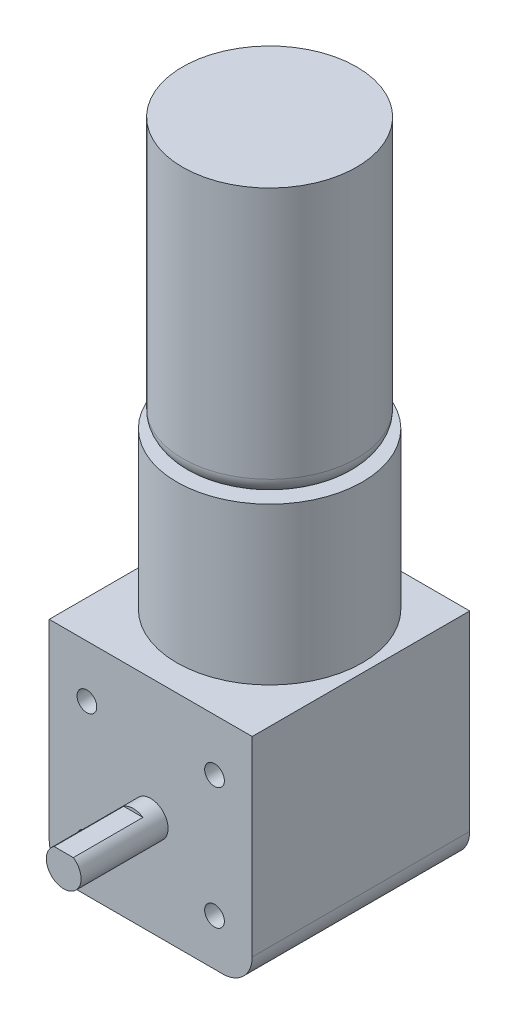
ISO-10303-21;
HEADER;
FILE_DESCRIPTION(('STEP AP214'),'2;1');
FILE_NAME('part.step','',(''),(''),'','','');
FILE_SCHEMA(('AUTOMOTIVE_DESIGN { 1 0 10303 214 1 1 1 1 }'));
ENDSEC;
DATA;
#1=APPLICATION_CONTEXT('core data for automotive mechanical design processes');
#2=APPLICATION_PROTOCOL_DEFINITION('international standard','automotive_design',2000,#1);
#3=PRODUCT_CONTEXT('',#1,'mechanical');
#4=PRODUCT('Part','Part','',(#3));
#5=PRODUCT_RELATED_PRODUCT_CATEGORY('part','',(#4));
#6=PRODUCT_DEFINITION_FORMATION('','',#4);
#7=PRODUCT_DEFINITION_CONTEXT('part definition',#1,'design');
#8=PRODUCT_DEFINITION('design','',#6,#7);
#9=PRODUCT_DEFINITION_SHAPE('','',#8);
#10=(LENGTH_UNIT() NAMED_UNIT(*) SI_UNIT(.MILLI.,.METRE.));
#11=(NAMED_UNIT(*) PLANE_ANGLE_UNIT() SI_UNIT($,.RADIAN.));
#12=(NAMED_UNIT(*) SI_UNIT($,.STERADIAN.) SOLID_ANGLE_UNIT());
#13=UNCERTAINTY_MEASURE_WITH_UNIT(LENGTH_MEASURE(1.E-05),#10,'distance_accuracy_value','');
#14=(GEOMETRIC_REPRESENTATION_CONTEXT(3) GLOBAL_UNCERTAINTY_ASSIGNED_CONTEXT((#13)) GLOBAL_UNIT_ASSIGNED_CONTEXT((#10,
#11,#12)) REPRESENTATION_CONTEXT('',''));
#15=CARTESIAN_POINT('',(0.,0.,0.));
#16=DIRECTION('',(0.,0.,1.));
#17=DIRECTION('',(1.,0.,0.));
#18=AXIS2_PLACEMENT_3D('',#15,#16,#17);
#19=CARTESIAN_POINT('',(-17.5,-38.,18.7500000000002));
#20=DIRECTION('',(0.,0.,1.));
#21=DIRECTION('',(1.,0.,0.));
#22=AXIS2_PLACEMENT_3D('',#19,#20,#21);
#23=PLANE('',#22);
#24=CARTESIAN_POINT('',(-11.,-9.,18.7500000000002));
#25=DIRECTION('',(0.,0.,1.));
#26=DIRECTION('',(1.,0.,0.));
#27=AXIS2_PLACEMENT_3D('',#24,#25,#26);
#28=CIRCLE('',#27,1.7);
#29=CARTESIAN_POINT('',(-9.30000000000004,-9.,18.7500000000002));
#30=VERTEX_POINT('',#29);
#31=EDGE_CURVE('E303',#30,#30,#28,.T.);
#32=ORIENTED_EDGE('',*,*,#31,.F.);
#33=EDGE_LOOP('',(#32));
#34=FACE_BOUND('',#33,.T.);
#35=CARTESIAN_POINT('',(11.,-9.,18.7500000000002));
#36=DIRECTION('',(0.,0.,1.));
#37=DIRECTION('',(1.,0.,0.));
#38=AXIS2_PLACEMENT_3D('',#35,#36,#37);
#39=CIRCLE('',#38,1.7);
#40=CARTESIAN_POINT('',(12.7,-9.,18.7500000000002));
#41=VERTEX_POINT('',#40);
#42=EDGE_CURVE('E309',#41,#41,#39,.T.);
#43=ORIENTED_EDGE('',*,*,#42,.F.);
#44=EDGE_LOOP('',(#43));
#45=FACE_BOUND('',#44,.T.);
#46=CARTESIAN_POINT('',(11.,-30.,18.7500000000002));
#47=DIRECTION('',(0.,0.,1.));
#48=DIRECTION('',(1.,0.,0.));
#49=AXIS2_PLACEMENT_3D('',#46,#47,#48);
#50=CIRCLE('',#49,1.7);
#51=CARTESIAN_POINT('',(12.7,-30.,18.7500000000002));
#52=VERTEX_POINT('',#51);
#53=EDGE_CURVE('E315',#52,#52,#50,.T.);
#54=ORIENTED_EDGE('',*,*,#53,.F.);
#55=EDGE_LOOP('',(#54));
#56=FACE_BOUND('',#55,.T.);
#57=CARTESIAN_POINT('',(-11.,-30.,18.7500000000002));
#58=DIRECTION('',(0.,0.,1.));
#59=DIRECTION('',(1.,0.,0.));
#60=AXIS2_PLACEMENT_3D('',#57,#58,#59);
#61=CIRCLE('',#60,1.7);
#62=CARTESIAN_POINT('',(-9.30000000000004,-30.,18.7500000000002));
#63=VERTEX_POINT('',#62);
#64=EDGE_CURVE('E320',#63,#63,#61,.T.);
#65=ORIENTED_EDGE('',*,*,#64,.F.);
#66=EDGE_LOOP('',(#65));
#67=FACE_BOUND('',#66,.T.);
#68=DIRECTION('',(0.,1.,0.));
#69=VECTOR('',#68,1.);
#70=CARTESIAN_POINT('',(-17.5,-38.,18.7500000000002));
#71=LINE('',#70,#69);
#72=CARTESIAN_POINT('',(-17.5,-32.92,18.7500000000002));
#73=VERTEX_POINT('',#72);
#74=CARTESIAN_POINT('',(-17.5,0.,18.7500000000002));
#75=VERTEX_POINT('',#74);
#76=EDGE_CURVE('E169',#73,#75,#71,.T.);
#77=ORIENTED_EDGE('',*,*,#76,.F.);
#78=CARTESIAN_POINT('',(-12.42,-32.92,18.7500000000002));
#79=DIRECTION('',(0.,0.,1.));
#80=DIRECTION('',(1.,0.,0.));
#81=AXIS2_PLACEMENT_3D('',#78,#79,#80);
#82=CIRCLE('',#81,5.08);
#83=CARTESIAN_POINT('',(-12.42,-38.,18.7500000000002));
#84=VERTEX_POINT('',#83);
#85=EDGE_CURVE('E178',#73,#84,#82,.T.);
#86=ORIENTED_EDGE('',*,*,#85,.T.);
#87=DIRECTION('',(1.,0.,0.));
#88=VECTOR('',#87,1.);
#89=CARTESIAN_POINT('',(-17.5,-38.,18.7500000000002));
#90=LINE('',#89,#88);
#91=CARTESIAN_POINT('',(12.42,-38.,18.7500000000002));
#92=VERTEX_POINT('',#91);
#93=EDGE_CURVE('E151',#84,#92,#90,.T.);
#94=ORIENTED_EDGE('',*,*,#93,.T.);
#95=CARTESIAN_POINT('',(12.42,-32.92,18.7500000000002));
#96=DIRECTION('',(0.,0.,1.));
#97=DIRECTION('',(1.,0.,0.));
#98=AXIS2_PLACEMENT_3D('',#95,#96,#97);
#99=CIRCLE('',#98,5.08);
#100=CARTESIAN_POINT('',(17.5,-32.92,18.7500000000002));
#101=VERTEX_POINT('',#100);
#102=EDGE_CURVE('E176',#92,#101,#99,.T.);
#103=ORIENTED_EDGE('',*,*,#102,.T.);
#104=DIRECTION('',(0.,1.,0.));
#105=VECTOR('',#104,1.);
#106=CARTESIAN_POINT('',(17.5,-38.,18.7500000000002));
#107=LINE('',#106,#105);
#108=CARTESIAN_POINT('',(17.5,0.,18.7500000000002));
#109=VERTEX_POINT('',#108);
#110=EDGE_CURVE('E166',#101,#109,#107,.T.);
#111=ORIENTED_EDGE('',*,*,#110,.T.);
#112=DIRECTION('',(1.,0.,0.));
#113=VECTOR('',#112,1.);
#114=CARTESIAN_POINT('',(-17.5,0.,18.7500000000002));
#115=LINE('',#114,#113);
#116=EDGE_CURVE('E152',#75,#109,#115,.T.);
#117=ORIENTED_EDGE('',*,*,#116,.F.);
#118=EDGE_LOOP('',(#77,#86,#94,#103,#111,#117));
#119=FACE_BOUND('',#118,.T.);
#120=CARTESIAN_POINT('',(0.,-21.,18.7500000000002));
#121=DIRECTION('',(0.,0.,1.));
#122=DIRECTION('',(1.,0.,0.));
#123=AXIS2_PLACEMENT_3D('',#120,#121,#122);
#124=CIRCLE('',#123,3.);
#125=CARTESIAN_POINT('',(3.,-21.,18.7500000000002));
#126=VERTEX_POINT('',#125);
#127=EDGE_CURVE('E125',#126,#126,#124,.T.);
#128=ORIENTED_EDGE('',*,*,#127,.F.);
#129=EDGE_LOOP('',(#128));
#130=FACE_BOUND('',#129,.T.);
#131=ADVANCED_FACE('F33',(#34,#45,#56,#67,#119,#130),#23,.T.);
#132=CARTESIAN_POINT('',(0.,27.,-1.74999999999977));
#133=DIRECTION('',(0.,1.,0.));
#134=DIRECTION('',(0.,0.,1.));
#135=AXIS2_PLACEMENT_3D('',#132,#133,#134);
#136=PLANE('',#135);
#137=CARTESIAN_POINT('',(0.,27.,-1.74999999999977));
#138=DIRECTION('',(0.,1.,0.));
#139=DIRECTION('',(0.,0.,1.));
#140=AXIS2_PLACEMENT_3D('',#137,#138,#139);
#141=CIRCLE('',#140,16.);
#142=CARTESIAN_POINT('',(0.,27.,14.2500000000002));
#143=VERTEX_POINT('',#142);
#144=EDGE_CURVE('E142',#143,#143,#141,.T.);
#145=ORIENTED_EDGE('',*,*,#144,.T.);
#146=EDGE_LOOP('',(#145));
#147=FACE_BOUND('',#146,.T.);
#148=CARTESIAN_POINT('',(0.,27.,-1.74999999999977));
#149=DIRECTION('',(0.,1.,0.));
#150=DIRECTION('',(0.,0.,1.));
#151=AXIS2_PLACEMENT_3D('',#148,#149,#150);
#152=CIRCLE('',#151,12.);
#153=CARTESIAN_POINT('',(0.,27.,10.2500000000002));
#154=VERTEX_POINT('',#153);
#155=EDGE_CURVE('E124',#154,#154,#152,.T.);
#156=ORIENTED_EDGE('',*,*,#155,.F.);
#157=EDGE_LOOP('',(#156));
#158=FACE_BOUND('',#157,.T.);
#159=ADVANCED_FACE('F226',(#147,#158),#136,.T.);
#160=CARTESIAN_POINT('',(0.,0.,0.));
#161=DIRECTION('',(0.,1.,0.));
#162=DIRECTION('',(0.,0.,1.));
#163=AXIS2_PLACEMENT_3D('',#160,#161,#162);
#164=PLANE('',#163);
#165=DIRECTION('',(0.,0.,-1.));
#166=VECTOR('',#165,1.);
#167=CARTESIAN_POINT('',(17.5,0.,-18.7499999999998));
#168=LINE('',#167,#166);
#169=CARTESIAN_POINT('',(17.5,0.,-18.7499999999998));
#170=VERTEX_POINT('',#169);
#171=EDGE_CURVE('E145',#109,#170,#168,.T.);
#172=ORIENTED_EDGE('',*,*,#171,.T.);
#173=DIRECTION('',(-1.,0.,0.));
#174=VECTOR('',#173,1.);
#175=CARTESIAN_POINT('',(-17.5,0.,-18.7499999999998));
#176=LINE('',#175,#174);
#177=CARTESIAN_POINT('',(-17.5,0.,-18.7499999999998));
#178=VERTEX_POINT('',#177);
#179=EDGE_CURVE('E158',#170,#178,#176,.T.);
#180=ORIENTED_EDGE('',*,*,#179,.T.);
#181=DIRECTION('',(0.,0.,1.));
#182=VECTOR('',#181,1.);
#183=CARTESIAN_POINT('',(-17.5,0.,-18.7499999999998));
#184=LINE('',#183,#182);
#185=EDGE_CURVE('E161',#178,#75,#184,.T.);
#186=ORIENTED_EDGE('',*,*,#185,.T.);
#187=ORIENTED_EDGE('',*,*,#116,.T.);
#188=EDGE_LOOP('',(#172,#180,#186,#187));
#189=FACE_BOUND('',#188,.T.);
#190=CARTESIAN_POINT('',(0.,0.,-1.74999999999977));
#191=DIRECTION('',(0.,1.,0.));
#192=DIRECTION('',(0.,0.,1.));
#193=AXIS2_PLACEMENT_3D('',#190,#191,#192);
#194=CIRCLE('',#193,16.);
#195=CARTESIAN_POINT('',(0.,0.,14.2500000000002));
#196=VERTEX_POINT('',#195);
#197=EDGE_CURVE('E141',#196,#196,#194,.T.);
#198=ORIENTED_EDGE('',*,*,#197,.F.);
#199=EDGE_LOOP('',(#198));
#200=FACE_BOUND('',#199,.T.);
#201=ADVANCED_FACE('F200',(#189,#200),#164,.T.);
#202=CARTESIAN_POINT('',(17.5,-38.,-18.7499999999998));
#203=DIRECTION('',(1.,0.,0.));
#204=DIRECTION('',(0.,0.,-1.));
#205=AXIS2_PLACEMENT_3D('',#202,#203,#204);
#206=PLANE('',#205);
#207=ORIENTED_EDGE('',*,*,#110,.F.);
#208=DIRECTION('',(0.,0.,-1.));
#209=VECTOR('',#208,1.);
#210=CARTESIAN_POINT('',(17.5,-32.92,-18.7499999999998));
#211=LINE('',#210,#209);
#212=CARTESIAN_POINT('',(17.5,-32.92,-18.7499999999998));
#213=VERTEX_POINT('',#212);
#214=EDGE_CURVE('E116',#101,#213,#211,.T.);
#215=ORIENTED_EDGE('',*,*,#214,.T.);
#216=DIRECTION('',(0.,1.,0.));
#217=VECTOR('',#216,1.);
#218=CARTESIAN_POINT('',(17.5,-38.,-18.7499999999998));
#219=LINE('',#218,#217);
#220=EDGE_CURVE('E155',#213,#170,#219,.T.);
#221=ORIENTED_EDGE('',*,*,#220,.T.);
#222=ORIENTED_EDGE('',*,*,#171,.F.);
#223=EDGE_LOOP('',(#207,#215,#221,#222));
#224=FACE_BOUND('',#223,.T.);
#225=ADVANCED_FACE('F190',(#224),#206,.T.);
#226=CARTESIAN_POINT('',(-17.5,-38.,-18.7499999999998));
#227=DIRECTION('',(-1.,0.,0.));
#228=DIRECTION('',(0.,0.,1.));
#229=AXIS2_PLACEMENT_3D('',#226,#227,#228);
#230=PLANE('',#229);
#231=DIRECTION('',(0.,1.,0.));
#232=VECTOR('',#231,1.);
#233=CARTESIAN_POINT('',(-17.5,-38.,-18.7499999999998));
#234=LINE('',#233,#232);
#235=CARTESIAN_POINT('',(-17.5,-32.92,-18.7499999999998));
#236=VERTEX_POINT('',#235);
#237=EDGE_CURVE('E171',#236,#178,#234,.T.);
#238=ORIENTED_EDGE('',*,*,#237,.F.);
#239=DIRECTION('',(0.,0.,1.));
#240=VECTOR('',#239,1.);
#241=CARTESIAN_POINT('',(-17.5,-32.92,18.7500000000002));
#242=LINE('',#241,#240);
#243=EDGE_CURVE('E168',#236,#73,#242,.T.);
#244=ORIENTED_EDGE('',*,*,#243,.T.);
#245=ORIENTED_EDGE('',*,*,#76,.T.);
#246=ORIENTED_EDGE('',*,*,#185,.F.);
#247=EDGE_LOOP('',(#238,#244,#245,#246));
#248=FACE_BOUND('',#247,.T.);
#249=ADVANCED_FACE('F215',(#248),#230,.T.);
#250=CARTESIAN_POINT('',(-17.5,-38.,-18.7499999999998));
#251=DIRECTION('',(0.,0.,-1.));
#252=DIRECTION('',(-1.,0.,0.));
#253=AXIS2_PLACEMENT_3D('',#250,#251,#252);
#254=PLANE('',#253);
#255=DIRECTION('',(-1.,0.,0.));
#256=VECTOR('',#255,1.);
#257=CARTESIAN_POINT('',(-17.5,-38.,-18.7499999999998));
#258=LINE('',#257,#256);
#259=CARTESIAN_POINT('',(12.42,-38.,-18.7499999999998));
#260=VERTEX_POINT('',#259);
#261=CARTESIAN_POINT('',(-12.42,-38.,-18.7499999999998));
#262=VERTEX_POINT('',#261);
#263=EDGE_CURVE('E148',#260,#262,#258,.T.);
#264=ORIENTED_EDGE('',*,*,#263,.T.);
#265=CARTESIAN_POINT('',(-12.42,-32.92,-18.7499999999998));
#266=DIRECTION('',(0.,0.,-1.));
#267=DIRECTION('',(-1.,0.,0.));
#268=AXIS2_PLACEMENT_3D('',#265,#266,#267);
#269=CIRCLE('',#268,5.08);
#270=EDGE_CURVE('E185',#262,#236,#269,.T.);
#271=ORIENTED_EDGE('',*,*,#270,.T.);
#272=ORIENTED_EDGE('',*,*,#237,.T.);
#273=ORIENTED_EDGE('',*,*,#179,.F.);
#274=ORIENTED_EDGE('',*,*,#220,.F.);
#275=CARTESIAN_POINT('',(12.42,-32.92,-18.7499999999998));
#276=DIRECTION('',(0.,0.,-1.));
#277=DIRECTION('',(-1.,0.,0.));
#278=AXIS2_PLACEMENT_3D('',#275,#276,#277);
#279=CIRCLE('',#278,5.08);
#280=EDGE_CURVE('E56',#213,#260,#279,.T.);
#281=ORIENTED_EDGE('',*,*,#280,.T.);
#282=EDGE_LOOP('',(#264,#271,#272,#273,#274,#281));
#283=FACE_BOUND('',#282,.T.);
#284=ADVANCED_FACE('F195',(#283),#254,.T.);
#285=CARTESIAN_POINT('',(0.,-38.,0.));
#286=DIRECTION('',(0.,1.,0.));
#287=DIRECTION('',(0.,0.,1.));
#288=AXIS2_PLACEMENT_3D('',#285,#286,#287);
#289=PLANE('',#288);
#290=ORIENTED_EDGE('',*,*,#93,.F.);
#291=DIRECTION('',(0.,0.,1.));
#292=VECTOR('',#291,1.);
#293=CARTESIAN_POINT('',(-12.42,-38.,-18.7499999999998));
#294=LINE('',#293,#292);
#295=EDGE_CURVE('E182',#84,#262,#294,.F.);
#296=ORIENTED_EDGE('',*,*,#295,.T.);
#297=ORIENTED_EDGE('',*,*,#263,.F.);
#298=DIRECTION('',(0.,0.,-1.));
#299=VECTOR('',#298,1.);
#300=CARTESIAN_POINT('',(12.42,-38.,18.7500000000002));
#301=LINE('',#300,#299);
#302=EDGE_CURVE('E180',#260,#92,#301,.F.);
#303=ORIENTED_EDGE('',*,*,#302,.T.);
#304=EDGE_LOOP('',(#290,#296,#297,#303));
#305=FACE_BOUND('',#304,.T.);
#306=ADVANCED_FACE('F208',(#305),#289,.F.);
#307=CARTESIAN_POINT('',(0.,27.,-1.74999999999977));
#308=DIRECTION('',(0.,-1.,0.));
#309=DIRECTION('',(0.,0.,-1.));
#310=AXIS2_PLACEMENT_3D('',#307,#308,#309);
#311=CYLINDRICAL_SURFACE('',#310,16.);
#312=ORIENTED_EDGE('',*,*,#144,.F.);
#313=EDGE_LOOP('',(#312));
#314=FACE_BOUND('',#313,.T.);
#315=ORIENTED_EDGE('',*,*,#197,.T.);
#316=EDGE_LOOP('',(#315));
#317=FACE_BOUND('',#316,.T.);
#318=ADVANCED_FACE('F240',(#314,#317),#311,.T.);
#319=CARTESIAN_POINT('',(0.,30.,-1.74999999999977));
#320=DIRECTION('',(0.,1.,0.));
#321=DIRECTION('',(0.,0.,1.));
#322=AXIS2_PLACEMENT_3D('',#319,#320,#321);
#323=TOROIDAL_SURFACE('',#322,12.,3.);
#324=ORIENTED_EDGE('',*,*,#155,.T.);
#325=EDGE_LOOP('',(#324));
#326=FACE_BOUND('',#325,.T.);
#327=CARTESIAN_POINT('',(0.,30.,-1.74999999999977));
#328=DIRECTION('',(0.,1.,0.));
#329=DIRECTION('',(0.,0.,1.));
#330=AXIS2_PLACEMENT_3D('',#327,#328,#329);
#331=CIRCLE('',#330,15.);
#332=CARTESIAN_POINT('',(0.,30.,-16.7499999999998));
#333=VERTEX_POINT('',#332);
#334=EDGE_CURVE('E128',#333,#333,#331,.T.);
#335=ORIENTED_EDGE('',*,*,#334,.F.);
#336=EDGE_LOOP('',(#335));
#337=FACE_BOUND('',#336,.T.);
#338=ADVANCED_FACE('F242',(#326,#337),#323,.T.);
#339=CARTESIAN_POINT('',(0.,73.5,-1.74999999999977));
#340=DIRECTION('',(0.,1.,0.));
#341=DIRECTION('',(0.,0.,1.));
#342=AXIS2_PLACEMENT_3D('',#339,#340,#341);
#343=PLANE('',#342);
#344=CARTESIAN_POINT('',(0.,73.5,-1.74999999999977));
#345=DIRECTION('',(0.,1.,0.));
#346=DIRECTION('',(0.,0.,1.));
#347=AXIS2_PLACEMENT_3D('',#344,#345,#346);
#348=CIRCLE('',#347,15.);
#349=CARTESIAN_POINT('',(0.,73.5,-16.7499999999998));
#350=VERTEX_POINT('',#349);
#351=EDGE_CURVE('E138',#350,#350,#348,.T.);
#352=ORIENTED_EDGE('',*,*,#351,.T.);
#353=EDGE_LOOP('',(#352));
#354=FACE_BOUND('',#353,.T.);
#355=ADVANCED_FACE('F248',(#354),#343,.T.);
#356=CARTESIAN_POINT('',(0.,73.5,-1.74999999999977));
#357=DIRECTION('',(0.,-1.,0.));
#358=DIRECTION('',(0.,0.,-1.));
#359=AXIS2_PLACEMENT_3D('',#356,#357,#358);
#360=CYLINDRICAL_SURFACE('',#359,15.);
#361=CARTESIAN_POINT('',(0.,30.,-16.7499999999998));
#362=CARTESIAN_POINT('',(0.,30.453125,-16.7499999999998));
#363=CARTESIAN_POINT('',(0.,30.90625,-16.7499999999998));
#364=CARTESIAN_POINT('',(0.,31.8125,-16.7499999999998));
#365=CARTESIAN_POINT('',(0.,32.265625,-16.7499999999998));
#366=CARTESIAN_POINT('',(0.,33.171875,-16.7499999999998));
#367=CARTESIAN_POINT('',(0.,33.625,-16.7499999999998));
#368=CARTESIAN_POINT('',(0.,34.53125,-16.7499999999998));
#369=CARTESIAN_POINT('',(0.,34.984375,-16.7499999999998));
#370=CARTESIAN_POINT('',(0.,35.890625,-16.7499999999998));
#371=CARTESIAN_POINT('',(0.,36.34375,-16.7499999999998));
#372=CARTESIAN_POINT('',(0.,37.25,-16.7499999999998));
#373=CARTESIAN_POINT('',(0.,37.703125,-16.7499999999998));
#374=CARTESIAN_POINT('',(0.,38.609375,-16.7499999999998));
#375=CARTESIAN_POINT('',(0.,39.0625,-16.7499999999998));
#376=CARTESIAN_POINT('',(0.,39.96875,-16.7499999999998));
#377=CARTESIAN_POINT('',(0.,40.421875,-16.7499999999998));
#378=CARTESIAN_POINT('',(0.,41.328125,-16.7499999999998));
#379=CARTESIAN_POINT('',(0.,41.78125,-16.7499999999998));
#380=CARTESIAN_POINT('',(0.,42.6875,-16.7499999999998));
#381=CARTESIAN_POINT('',(0.,43.140625,-16.7499999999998));
#382=CARTESIAN_POINT('',(0.,44.046875,-16.7499999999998));
#383=CARTESIAN_POINT('',(0.,44.5,-16.7499999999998));
#384=CARTESIAN_POINT('',(0.,45.40625,-16.7499999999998));
#385=CARTESIAN_POINT('',(0.,45.859375,-16.7499999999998));
#386=CARTESIAN_POINT('',(0.,46.765625,-16.7499999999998));
#387=CARTESIAN_POINT('',(0.,47.21875,-16.7499999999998));
#388=CARTESIAN_POINT('',(0.,48.125,-16.7499999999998));
#389=CARTESIAN_POINT('',(0.,48.578125,-16.7499999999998));
#390=CARTESIAN_POINT('',(0.,49.484375,-16.7499999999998));
#391=CARTESIAN_POINT('',(0.,49.9375,-16.7499999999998));
#392=CARTESIAN_POINT('',(0.,50.84375,-16.7499999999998));
#393=CARTESIAN_POINT('',(0.,51.296875,-16.7499999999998));
#394=CARTESIAN_POINT('',(0.,52.203125,-16.7499999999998));
#395=CARTESIAN_POINT('',(0.,52.65625,-16.7499999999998));
#396=CARTESIAN_POINT('',(0.,53.5625,-16.7499999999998));
#397=CARTESIAN_POINT('',(0.,54.015625,-16.7499999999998));
#398=CARTESIAN_POINT('',(0.,54.921875,-16.7499999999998));
#399=CARTESIAN_POINT('',(0.,55.375,-16.7499999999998));
#400=CARTESIAN_POINT('',(0.,56.28125,-16.7499999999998));
#401=CARTESIAN_POINT('',(0.,56.734375,-16.7499999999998));
#402=CARTESIAN_POINT('',(0.,57.640625,-16.7499999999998));
#403=CARTESIAN_POINT('',(0.,58.09375,-16.7499999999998));
#404=CARTESIAN_POINT('',(0.,59.,-16.7499999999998));
#405=CARTESIAN_POINT('',(0.,59.453125,-16.7499999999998));
#406=CARTESIAN_POINT('',(0.,60.359375,-16.7499999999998));
#407=CARTESIAN_POINT('',(0.,60.8125,-16.7499999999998));
#408=CARTESIAN_POINT('',(0.,61.71875,-16.7499999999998));
#409=CARTESIAN_POINT('',(0.,62.171875,-16.7499999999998));
#410=CARTESIAN_POINT('',(0.,63.078125,-16.7499999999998));
#411=CARTESIAN_POINT('',(0.,63.53125,-16.7499999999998));
#412=CARTESIAN_POINT('',(0.,64.4375,-16.7499999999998));
#413=CARTESIAN_POINT('',(0.,64.890625,-16.7499999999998));
#414=CARTESIAN_POINT('',(0.,65.796875,-16.7499999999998));
#415=CARTESIAN_POINT('',(0.,66.25,-16.7499999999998));
#416=CARTESIAN_POINT('',(0.,67.15625,-16.7499999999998));
#417=CARTESIAN_POINT('',(0.,67.609375,-16.7499999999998));
#418=CARTESIAN_POINT('',(0.,68.515625,-16.7499999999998));
#419=CARTESIAN_POINT('',(0.,68.96875,-16.7499999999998));
#420=CARTESIAN_POINT('',(0.,69.875,-16.7499999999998));
#421=CARTESIAN_POINT('',(0.,70.328125,-16.7499999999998));
#422=CARTESIAN_POINT('',(0.,71.234375,-16.7499999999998));
#423=CARTESIAN_POINT('',(0.,71.6875,-16.7499999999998));
#424=CARTESIAN_POINT('',(0.,72.59375,-16.7499999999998));
#425=CARTESIAN_POINT('',(0.,73.046875,-16.7499999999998));
#426=CARTESIAN_POINT('',(0.,73.5,-16.7499999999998));
#427=B_SPLINE_CURVE_WITH_KNOTS('',3,(#361,#362,#363,#364,#365,#366,#367,#368,#369,#370,#371,
#372,#373,#374,#375,#376,#377,#378,#379,#380,#381,#382,#383,#384,#385,#386,#387,#388,#389,#390,
#391,#392,#393,#394,#395,#396,#397,#398,#399,#400,#401,#402,#403,#404,#405,#406,#407,#408,#409,
#410,#411,#412,#413,#414,#415,#416,#417,#418,#419,#420,#421,#422,#423,#424,#425,#426),
.UNSPECIFIED.,.F.,.F.,(4,2,2,2,2,2,2,2,2,2,2,2,2,2,2,2,2,2,2,2,2,2,2,2,2,2,2,2,2,2,2,2,4),(0.,
1.359375,2.71875,4.078125,5.4375,6.796875,8.15625,9.515625,10.875,12.234375,13.59375,14.953125,
16.3125,17.671875,19.03125,20.390625,21.75,23.109375,24.46875,25.828125,27.1875,28.546875,
29.90625,31.265625,32.625,33.984375,35.34375,36.703125,38.0625,39.421875,40.78125,42.140625,
43.5),.UNSPECIFIED.);
#428=EDGE_CURVE('BSEAM245',#333,#350,#427,.T.);
#429=ORIENTED_EDGE('',*,*,#334,.T.);
#430=ORIENTED_EDGE('',*,*,#351,.F.);
#431=ORIENTED_EDGE('',*,*,#428,.T.);
#432=ORIENTED_EDGE('',*,*,#428,.F.);
#433=EDGE_LOOP('',(#429,#431,#430,#432));
#434=FACE_BOUND('',#433,.T.);
#435=ADVANCED_FACE('F245',(#434),#360,.T.);
#436=CARTESIAN_POINT('',(0.,-21.,33.7500000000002));
#437=DIRECTION('',(0.,0.,-1.));
#438=DIRECTION('',(-1.,0.,0.));
#439=AXIS2_PLACEMENT_3D('',#436,#437,#438);
#440=CYLINDRICAL_SURFACE('',#439,3.);
#441=CARTESIAN_POINT('',(0.,-21.,33.7500000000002));
#442=DIRECTION('',(0.,0.,1.));
#443=DIRECTION('',(1.,0.,0.));
#444=AXIS2_PLACEMENT_3D('',#441,#442,#443);
#445=CIRCLE('',#444,3.);
#446=CARTESIAN_POINT('',(-1.6583123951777,-18.5,33.7500000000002));
#447=VERTEX_POINT('',#446);
#448=CARTESIAN_POINT('',(1.6583123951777,-18.5,33.7500000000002));
#449=VERTEX_POINT('',#448);
#450=EDGE_CURVE('E120',#447,#449,#445,.T.);
#451=ORIENTED_EDGE('',*,*,#450,.F.);
#452=DIRECTION('',(0.,0.,-1.));
#453=VECTOR('',#452,1.);
#454=CARTESIAN_POINT('',(-1.6583123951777,-18.5,33.7500000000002));
#455=LINE('',#454,#453);
#456=CARTESIAN_POINT('',(-1.6583123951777,-18.5,21.7500000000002));
#457=VERTEX_POINT('',#456);
#458=EDGE_CURVE('E48',#447,#457,#455,.T.);
#459=ORIENTED_EDGE('',*,*,#458,.T.);
#460=CARTESIAN_POINT('',(0.,-21.,21.7500000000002));
#461=DIRECTION('',(0.,0.,1.));
#462=DIRECTION('',(1.,0.,0.));
#463=AXIS2_PLACEMENT_3D('',#460,#461,#462);
#464=CIRCLE('',#463,3.);
#465=CARTESIAN_POINT('',(1.6583123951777,-18.5,21.7500000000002));
#466=VERTEX_POINT('',#465);
#467=EDGE_CURVE('E11',#466,#457,#464,.T.);
#468=ORIENTED_EDGE('',*,*,#467,.F.);
#469=DIRECTION('',(0.,0.,-1.));
#470=VECTOR('',#469,1.);
#471=CARTESIAN_POINT('',(1.6583123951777,-18.5,33.7500000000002));
#472=LINE('',#471,#470);
#473=EDGE_CURVE('E111',#466,#449,#472,.F.);
#474=ORIENTED_EDGE('',*,*,#473,.T.);
#475=EDGE_LOOP('',(#451,#459,#468,#474));
#476=FACE_BOUND('',#475,.T.);
#477=ORIENTED_EDGE('',*,*,#127,.T.);
#478=EDGE_LOOP('',(#477));
#479=FACE_BOUND('',#478,.T.);
#480=ADVANCED_FACE('F118',(#476,#479),#440,.T.);
#481=CARTESIAN_POINT('',(0.,-21.,33.7500000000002));
#482=DIRECTION('',(0.,0.,1.));
#483=DIRECTION('',(1.,0.,0.));
#484=AXIS2_PLACEMENT_3D('',#481,#482,#483);
#485=PLANE('',#484);
#486=DIRECTION('',(1.,0.,0.));
#487=VECTOR('',#486,1.);
#488=CARTESIAN_POINT('',(0.,-18.5,33.7500000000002));
#489=LINE('',#488,#487);
#490=EDGE_CURVE('E41',#447,#449,#489,.T.);
#491=ORIENTED_EDGE('',*,*,#490,.F.);
#492=ORIENTED_EDGE('',*,*,#450,.T.);
#493=EDGE_LOOP('',(#491,#492));
#494=FACE_BOUND('',#493,.T.);
#495=ADVANCED_FACE('F123',(#494),#485,.T.);
#496=CARTESIAN_POINT('',(-11.,-30.,6.05000000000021));
#497=DIRECTION('',(0.,0.,1.));
#498=DIRECTION('',(1.,0.,0.));
#499=AXIS2_PLACEMENT_3D('',#496,#497,#498);
#500=CONICAL_SURFACE('',#499,1.7,1.02974425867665);
#501=CARTESIAN_POINT('',(-11.,-30.,5.02853694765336));
#502=VERTEX_POINT('',#501);
#503=VERTEX_LOOP('',#502);
#504=FACE_BOUND('',#503,.T.);
#505=CARTESIAN_POINT('',(-11.,-30.,6.05000000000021));
#506=DIRECTION('',(0.,0.,1.));
#507=DIRECTION('',(1.,0.,0.));
#508=AXIS2_PLACEMENT_3D('',#505,#506,#507);
#509=CIRCLE('',#508,1.7);
#510=CARTESIAN_POINT('',(-9.30000000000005,-30.,6.05000000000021));
#511=VERTEX_POINT('',#510);
#512=EDGE_CURVE('E131',#511,#511,#509,.T.);
#513=ORIENTED_EDGE('',*,*,#512,.T.);
#514=EDGE_LOOP('',(#513));
#515=FACE_BOUND('',#514,.T.);
#516=ADVANCED_FACE('F260',(#504,#515),#500,.F.);
#517=CARTESIAN_POINT('',(-11.,-30.,18.7500000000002));
#518=DIRECTION('',(0.,0.,1.));
#519=DIRECTION('',(1.,0.,0.));
#520=AXIS2_PLACEMENT_3D('',#517,#518,#519);
#521=CYLINDRICAL_SURFACE('',#520,1.7);
#522=ORIENTED_EDGE('',*,*,#512,.F.);
#523=EDGE_LOOP('',(#522));
#524=FACE_BOUND('',#523,.T.);
#525=ORIENTED_EDGE('',*,*,#64,.T.);
#526=EDGE_LOOP('',(#525));
#527=FACE_BOUND('',#526,.T.);
#528=ADVANCED_FACE('F263',(#524,#527),#521,.F.);
#529=CARTESIAN_POINT('',(11.,-30.,6.05000000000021));
#530=DIRECTION('',(0.,0.,1.));
#531=DIRECTION('',(1.,0.,0.));
#532=AXIS2_PLACEMENT_3D('',#529,#530,#531);
#533=CONICAL_SURFACE('',#532,1.7,1.02974425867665);
#534=CARTESIAN_POINT('',(11.,-30.,5.02853694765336));
#535=VERTEX_POINT('',#534);
#536=VERTEX_LOOP('',#535);
#537=FACE_BOUND('',#536,.T.);
#538=CARTESIAN_POINT('',(11.,-30.,6.05000000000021));
#539=DIRECTION('',(0.,0.,1.));
#540=DIRECTION('',(1.,0.,0.));
#541=AXIS2_PLACEMENT_3D('',#538,#539,#540);
#542=CIRCLE('',#541,1.7);
#543=CARTESIAN_POINT('',(12.7,-30.,6.05000000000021));
#544=VERTEX_POINT('',#543);
#545=EDGE_CURVE('E318',#544,#544,#542,.T.);
#546=ORIENTED_EDGE('',*,*,#545,.T.);
#547=EDGE_LOOP('',(#546));
#548=FACE_BOUND('',#547,.T.);
#549=ADVANCED_FACE('F267',(#537,#548),#533,.F.);
#550=CARTESIAN_POINT('',(11.,-30.,18.7500000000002));
#551=DIRECTION('',(0.,0.,1.));
#552=DIRECTION('',(1.,0.,0.));
#553=AXIS2_PLACEMENT_3D('',#550,#551,#552);
#554=CYLINDRICAL_SURFACE('',#553,1.7);
#555=ORIENTED_EDGE('',*,*,#545,.F.);
#556=EDGE_LOOP('',(#555));
#557=FACE_BOUND('',#556,.T.);
#558=ORIENTED_EDGE('',*,*,#53,.T.);
#559=EDGE_LOOP('',(#558));
#560=FACE_BOUND('',#559,.T.);
#561=ADVANCED_FACE('F271',(#557,#560),#554,.F.);
#562=CARTESIAN_POINT('',(11.,-9.,6.05000000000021));
#563=DIRECTION('',(0.,0.,1.));
#564=DIRECTION('',(1.,0.,0.));
#565=AXIS2_PLACEMENT_3D('',#562,#563,#564);
#566=CONICAL_SURFACE('',#565,1.7,1.02974425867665);
#567=CARTESIAN_POINT('',(11.,-9.,5.02853694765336));
#568=VERTEX_POINT('',#567);
#569=VERTEX_LOOP('',#568);
#570=FACE_BOUND('',#569,.T.);
#571=CARTESIAN_POINT('',(11.,-9.,6.05000000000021));
#572=DIRECTION('',(0.,0.,1.));
#573=DIRECTION('',(1.,0.,0.));
#574=AXIS2_PLACEMENT_3D('',#571,#572,#573);
#575=CIRCLE('',#574,1.7);
#576=CARTESIAN_POINT('',(12.7,-9.,6.05000000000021));
#577=VERTEX_POINT('',#576);
#578=EDGE_CURVE('E312',#577,#577,#575,.T.);
#579=ORIENTED_EDGE('',*,*,#578,.T.);
#580=EDGE_LOOP('',(#579));
#581=FACE_BOUND('',#580,.T.);
#582=ADVANCED_FACE('F275',(#570,#581),#566,.F.);
#583=CARTESIAN_POINT('',(11.,-9.,18.7500000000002));
#584=DIRECTION('',(0.,0.,1.));
#585=DIRECTION('',(1.,0.,0.));
#586=AXIS2_PLACEMENT_3D('',#583,#584,#585);
#587=CYLINDRICAL_SURFACE('',#586,1.7);
#588=ORIENTED_EDGE('',*,*,#578,.F.);
#589=EDGE_LOOP('',(#588));
#590=FACE_BOUND('',#589,.T.);
#591=ORIENTED_EDGE('',*,*,#42,.T.);
#592=EDGE_LOOP('',(#591));
#593=FACE_BOUND('',#592,.T.);
#594=ADVANCED_FACE('F279',(#590,#593),#587,.F.);
#595=CARTESIAN_POINT('',(-11.,-9.,6.05000000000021));
#596=DIRECTION('',(0.,0.,1.));
#597=DIRECTION('',(1.,0.,0.));
#598=AXIS2_PLACEMENT_3D('',#595,#596,#597);
#599=CONICAL_SURFACE('',#598,1.7,1.02974425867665);
#600=CARTESIAN_POINT('',(-11.,-9.,5.02853694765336));
#601=VERTEX_POINT('',#600);
#602=VERTEX_LOOP('',#601);
#603=FACE_BOUND('',#602,.T.);
#604=CARTESIAN_POINT('',(-11.,-9.,6.05000000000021));
#605=DIRECTION('',(0.,0.,1.));
#606=DIRECTION('',(1.,0.,0.));
#607=AXIS2_PLACEMENT_3D('',#604,#605,#606);
#608=CIRCLE('',#607,1.7);
#609=CARTESIAN_POINT('',(-9.30000000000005,-9.,6.05000000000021));
#610=VERTEX_POINT('',#609);
#611=EDGE_CURVE('E306',#610,#610,#608,.T.);
#612=ORIENTED_EDGE('',*,*,#611,.T.);
#613=EDGE_LOOP('',(#612));
#614=FACE_BOUND('',#613,.T.);
#615=ADVANCED_FACE('F283',(#603,#614),#599,.F.);
#616=CARTESIAN_POINT('',(-11.,-9.,18.7500000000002));
#617=DIRECTION('',(0.,0.,1.));
#618=DIRECTION('',(1.,0.,0.));
#619=AXIS2_PLACEMENT_3D('',#616,#617,#618);
#620=CYLINDRICAL_SURFACE('',#619,1.7);
#621=ORIENTED_EDGE('',*,*,#611,.F.);
#622=EDGE_LOOP('',(#621));
#623=FACE_BOUND('',#622,.T.);
#624=ORIENTED_EDGE('',*,*,#31,.T.);
#625=EDGE_LOOP('',(#624));
#626=FACE_BOUND('',#625,.T.);
#627=ADVANCED_FACE('F287',(#623,#626),#620,.F.);
#628=CARTESIAN_POINT('',(-12.42,-32.92,-18.7499999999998));
#629=DIRECTION('',(0.,0.,-1.));
#630=DIRECTION('',(-1.,0.,0.));
#631=AXIS2_PLACEMENT_3D('',#628,#629,#630);
#632=CYLINDRICAL_SURFACE('',#631,5.08);
#633=ORIENTED_EDGE('',*,*,#270,.F.);
#634=ORIENTED_EDGE('',*,*,#295,.F.);
#635=ORIENTED_EDGE('',*,*,#85,.F.);
#636=ORIENTED_EDGE('',*,*,#243,.F.);
#637=EDGE_LOOP('',(#633,#634,#635,#636));
#638=FACE_BOUND('',#637,.T.);
#639=ADVANCED_FACE('F213',(#638),#632,.T.);
#640=CARTESIAN_POINT('',(12.42,-32.92,-18.7499999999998));
#641=DIRECTION('',(0.,0.,1.));
#642=DIRECTION('',(1.,0.,0.));
#643=AXIS2_PLACEMENT_3D('',#640,#641,#642);
#644=CYLINDRICAL_SURFACE('',#643,5.08);
#645=ORIENTED_EDGE('',*,*,#102,.F.);
#646=ORIENTED_EDGE('',*,*,#302,.F.);
#647=ORIENTED_EDGE('',*,*,#280,.F.);
#648=ORIENTED_EDGE('',*,*,#214,.F.);
#649=EDGE_LOOP('',(#645,#646,#647,#648));
#650=FACE_BOUND('',#649,.T.);
#651=ADVANCED_FACE('F35',(#650),#644,.T.);
#652=CARTESIAN_POINT('',(0.,0.,21.7500000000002));
#653=DIRECTION('',(0.,0.,1.));
#654=DIRECTION('',(1.,0.,0.));
#655=AXIS2_PLACEMENT_3D('',#652,#653,#654);
#656=PLANE('',#655);
#657=DIRECTION('',(1.,0.,0.));
#658=VECTOR('',#657,1.);
#659=CARTESIAN_POINT('',(-2.54000000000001,-18.5,21.7500000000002));
#660=LINE('',#659,#658);
#661=EDGE_CURVE('E121',#457,#466,#660,.T.);
#662=ORIENTED_EDGE('',*,*,#661,.T.);
#663=ORIENTED_EDGE('',*,*,#467,.T.);
#664=EDGE_LOOP('',(#662,#663));
#665=FACE_BOUND('',#664,.T.);
#666=ADVANCED_FACE('F294',(#665),#656,.T.);
#667=CARTESIAN_POINT('',(-2.54000000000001,-18.5,21.7500000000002));
#668=DIRECTION('',(0.,-1.,0.));
#669=DIRECTION('',(0.,0.,-1.));
#670=AXIS2_PLACEMENT_3D('',#667,#668,#669);
#671=PLANE('',#670);
#672=ORIENTED_EDGE('',*,*,#490,.T.);
#673=ORIENTED_EDGE('',*,*,#473,.F.);
#674=ORIENTED_EDGE('',*,*,#661,.F.);
#675=ORIENTED_EDGE('',*,*,#458,.F.);
#676=EDGE_LOOP('',(#672,#673,#674,#675));
#677=FACE_BOUND('',#676,.T.);
#678=ADVANCED_FACE('F110',(#677),#671,.F.);
#679=CLOSED_SHELL('',(#131,#159,#201,#225,#249,#284,#306,#318,#338,#355,#435,#480,#495,#516,
#528,#549,#561,#582,#594,#615,#627,#639,#651,#666,#678));
#680=MANIFOLD_SOLID_BREP('B2',#679);
#681=ADVANCED_BREP_SHAPE_REPRESENTATION('',(#18,#680),#14);
#682=SHAPE_DEFINITION_REPRESENTATION(#9,#681);
ENDSEC;
END-ISO-10303-21;
